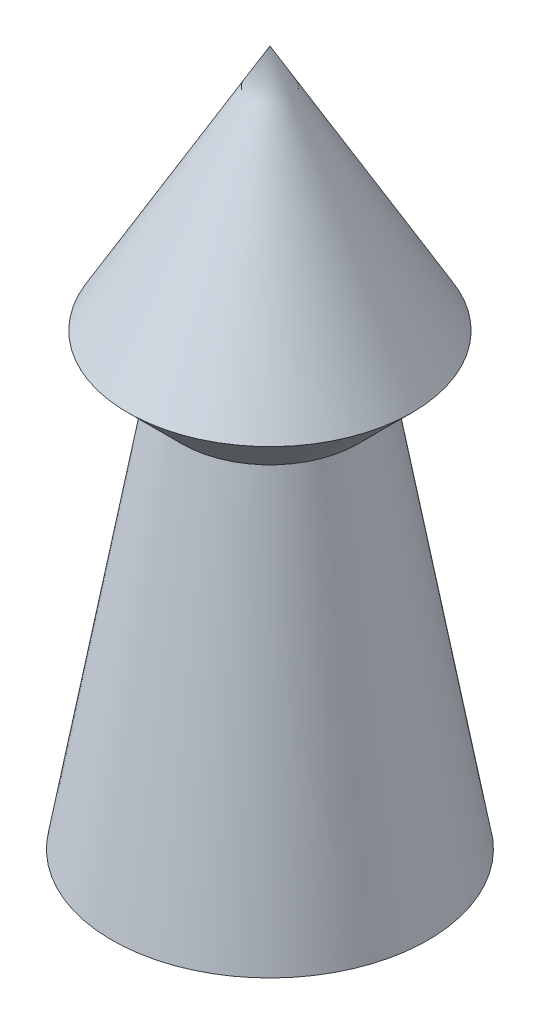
ISO-10303-21;
HEADER;
FILE_DESCRIPTION(('STEP AP214'),'2;1');
FILE_NAME('part.step','',(''),(''),'','','');
FILE_SCHEMA(('AUTOMOTIVE_DESIGN { 1 0 10303 214 1 1 1 1 }'));
ENDSEC;
DATA;
#1=APPLICATION_CONTEXT('core data for automotive mechanical design processes');
#2=APPLICATION_PROTOCOL_DEFINITION('international standard','automotive_design',2000,#1);
#3=PRODUCT_CONTEXT('',#1,'mechanical');
#4=PRODUCT('Part','Part','',(#3));
#5=PRODUCT_RELATED_PRODUCT_CATEGORY('part','',(#4));
#6=PRODUCT_DEFINITION_FORMATION('','',#4);
#7=PRODUCT_DEFINITION_CONTEXT('part definition',#1,'design');
#8=PRODUCT_DEFINITION('design','',#6,#7);
#9=PRODUCT_DEFINITION_SHAPE('','',#8);
#10=(LENGTH_UNIT() NAMED_UNIT(*) SI_UNIT(.MILLI.,.METRE.));
#11=(NAMED_UNIT(*) PLANE_ANGLE_UNIT() SI_UNIT($,.RADIAN.));
#12=(NAMED_UNIT(*) SI_UNIT($,.STERADIAN.) SOLID_ANGLE_UNIT());
#13=UNCERTAINTY_MEASURE_WITH_UNIT(LENGTH_MEASURE(1.E-05),#10,'distance_accuracy_value','');
#14=(GEOMETRIC_REPRESENTATION_CONTEXT(3) GLOBAL_UNCERTAINTY_ASSIGNED_CONTEXT((#13)) GLOBAL_UNIT_ASSIGNED_CONTEXT((#10,
#11,#12)) REPRESENTATION_CONTEXT('',''));
#15=CARTESIAN_POINT('',(0.,0.,0.));
#16=DIRECTION('',(0.,0.,1.));
#17=DIRECTION('',(1.,0.,0.));
#18=AXIS2_PLACEMENT_3D('',#15,#16,#17);
#19=CARTESIAN_POINT('',(0.,0.,0.));
#20=DIRECTION('',(0.,1.,0.));
#21=DIRECTION('',(-1.,0.,0.));
#22=AXIS2_PLACEMENT_3D('',#19,#20,#21);
#23=PLANE('',#22);
#24=CARTESIAN_POINT('',(0.,0.,0.));
#25=DIRECTION('',(0.,1.,0.));
#26=DIRECTION('',(-1.,0.,0.));
#27=AXIS2_PLACEMENT_3D('',#24,#25,#26);
#28=CIRCLE('',#27,10.);
#29=CARTESIAN_POINT('',(-10.,0.,0.));
#30=VERTEX_POINT('',#29);
#31=EDGE_CURVE('E11',#30,#30,#28,.T.);
#32=ORIENTED_EDGE('',*,*,#31,.F.);
#33=EDGE_LOOP('',(#32));
#34=FACE_BOUND('',#33,.T.);
#35=ADVANCED_FACE('F36',(#34),#23,.F.);
#36=CARTESIAN_POINT('',(0.,0.,0.));
#37=DIRECTION('',(0.,-1.,0.));
#38=DIRECTION('',(1.,0.,0.));
#39=AXIS2_PLACEMENT_3D('',#36,#37,#38);
#40=CONICAL_SURFACE('',#39,10.,0.174532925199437);
#41=CARTESIAN_POINT('',(0.,25.,0.));
#42=DIRECTION('',(0.,1.,0.));
#43=DIRECTION('',(-1.,0.,0.));
#44=AXIS2_PLACEMENT_3D('',#41,#42,#43);
#45=CIRCLE('',#44,5.59182548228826);
#46=CARTESIAN_POINT('',(-5.59182548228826,25.,0.));
#47=VERTEX_POINT('',#46);
#48=EDGE_CURVE('E42',#47,#47,#45,.T.);
#49=ORIENTED_EDGE('',*,*,#48,.F.);
#50=EDGE_LOOP('',(#49));
#51=FACE_BOUND('',#50,.T.);
#52=ORIENTED_EDGE('',*,*,#31,.T.);
#53=EDGE_LOOP('',(#52));
#54=FACE_BOUND('',#53,.T.);
#55=ADVANCED_FACE('F59',(#51,#54),#40,.T.);
#56=CARTESIAN_POINT('',(0.,25.,0.));
#57=DIRECTION('',(0.,1.,0.));
#58=DIRECTION('',(-1.,0.,0.));
#59=AXIS2_PLACEMENT_3D('',#56,#57,#58);
#60=CONICAL_SURFACE('',#59,5.59182548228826,0.785398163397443);
#61=CARTESIAN_POINT('',(0.,28.4094073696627,0.));
#62=DIRECTION('',(0.,1.,0.));
#63=DIRECTION('',(-1.,0.,0.));
#64=AXIS2_PLACEMENT_3D('',#61,#62,#63);
#65=CIRCLE('',#64,9.00123285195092);
#66=CARTESIAN_POINT('',(-9.00123285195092,28.4094073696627,0.));
#67=VERTEX_POINT('',#66);
#68=EDGE_CURVE('E52',#67,#67,#65,.T.);
#69=ORIENTED_EDGE('',*,*,#68,.F.);
#70=EDGE_LOOP('',(#69));
#71=FACE_BOUND('',#70,.T.);
#72=ORIENTED_EDGE('',*,*,#48,.T.);
#73=EDGE_LOOP('',(#72));
#74=FACE_BOUND('',#73,.T.);
#75=ADVANCED_FACE('F48',(#71,#74),#60,.T.);
#76=CARTESIAN_POINT('',(0.,28.4094073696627,0.));
#77=DIRECTION('',(0.,-1.,0.));
#78=DIRECTION('',(1.,0.,0.));
#79=AXIS2_PLACEMENT_3D('',#76,#77,#78);
#80=CONICAL_SURFACE('',#79,9.00123285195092,0.523598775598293);
#81=CARTESIAN_POINT('',(0.,44.,0.));
#82=VERTEX_POINT('',#81);
#83=VERTEX_LOOP('',#82);
#84=FACE_BOUND('',#83,.T.);
#85=ORIENTED_EDGE('',*,*,#68,.T.);
#86=EDGE_LOOP('',(#85));
#87=FACE_BOUND('',#86,.T.);
#88=ADVANCED_FACE('F45',(#84,#87),#80,.T.);
#89=CLOSED_SHELL('',(#35,#55,#75,#88));
#90=MANIFOLD_SOLID_BREP('B2',#89);
#91=ADVANCED_BREP_SHAPE_REPRESENTATION('',(#18,#90),#14);
#92=SHAPE_DEFINITION_REPRESENTATION(#9,#91);
ENDSEC;
END-ISO-10303-21;
